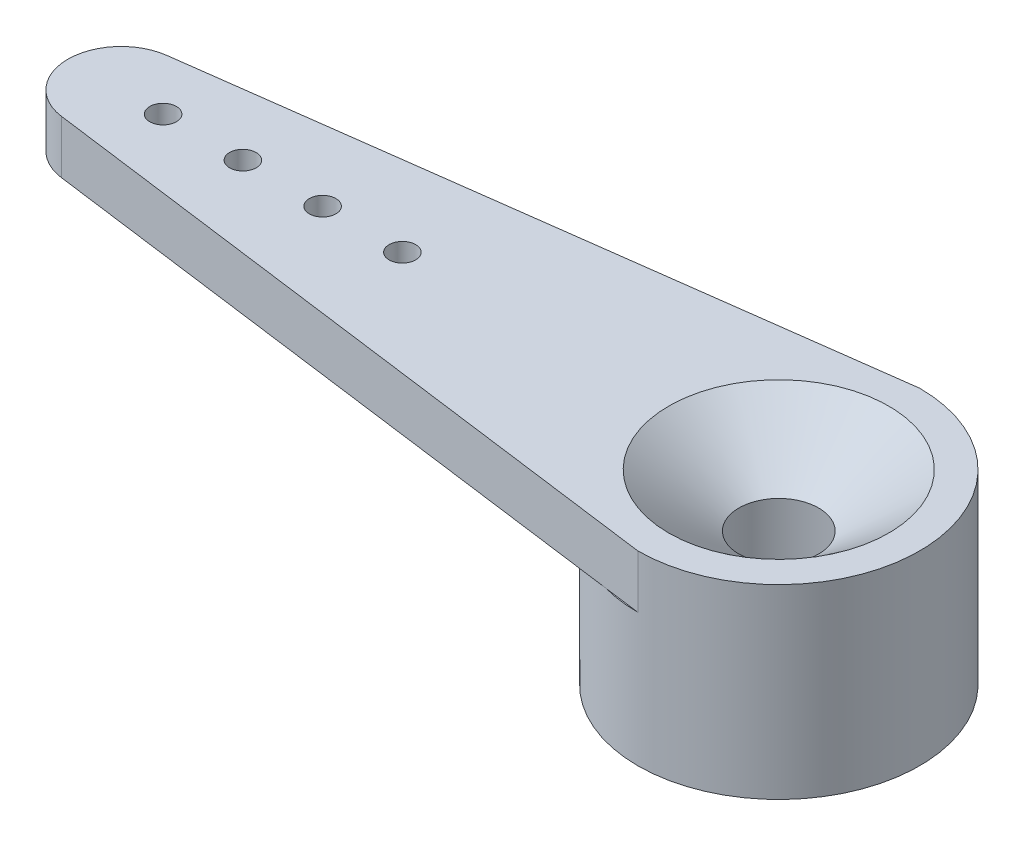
ISO-10303-21;
HEADER;
FILE_DESCRIPTION(('STEP AP214'),'2;1');
FILE_NAME('part.step','',(''),(''),'','','');
FILE_SCHEMA(('AUTOMOTIVE_DESIGN { 1 0 10303 214 1 1 1 1 }'));
ENDSEC;
DATA;
#1=APPLICATION_CONTEXT('core data for automotive mechanical design processes');
#2=APPLICATION_PROTOCOL_DEFINITION('international standard','automotive_design',2000,#1);
#3=PRODUCT_CONTEXT('',#1,'mechanical');
#4=PRODUCT('Part','Part','',(#3));
#5=PRODUCT_RELATED_PRODUCT_CATEGORY('part','',(#4));
#6=PRODUCT_DEFINITION_FORMATION('','',#4);
#7=PRODUCT_DEFINITION_CONTEXT('part definition',#1,'design');
#8=PRODUCT_DEFINITION('design','',#6,#7);
#9=PRODUCT_DEFINITION_SHAPE('','',#8);
#10=(LENGTH_UNIT() NAMED_UNIT(*) SI_UNIT(.MILLI.,.METRE.));
#11=(NAMED_UNIT(*) PLANE_ANGLE_UNIT() SI_UNIT($,.RADIAN.));
#12=(NAMED_UNIT(*) SI_UNIT($,.STERADIAN.) SOLID_ANGLE_UNIT());
#13=UNCERTAINTY_MEASURE_WITH_UNIT(LENGTH_MEASURE(1.E-05),#10,'distance_accuracy_value','');
#14=(GEOMETRIC_REPRESENTATION_CONTEXT(3) GLOBAL_UNCERTAINTY_ASSIGNED_CONTEXT((#13)) GLOBAL_UNIT_ASSIGNED_CONTEXT((#10,
#11,#12)) REPRESENTATION_CONTEXT('',''));
#15=CARTESIAN_POINT('',(0.,0.,0.));
#16=DIRECTION('',(0.,0.,1.));
#17=DIRECTION('',(1.,0.,0.));
#18=AXIS2_PLACEMENT_3D('',#15,#16,#17);
#19=CARTESIAN_POINT('',(0.,7.,0.));
#20=DIRECTION('',(0.,-1.,0.));
#21=DIRECTION('',(0.,0.,-1.));
#22=AXIS2_PLACEMENT_3D('',#19,#20,#21);
#23=PLANE('',#22);
#24=CARTESIAN_POINT('',(-14.1557519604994,7.,0.));
#25=DIRECTION('',(0.,1.,0.));
#26=DIRECTION('',(0.,0.,1.));
#27=AXIS2_PLACEMENT_3D('',#24,#25,#26);
#28=CIRCLE('',#27,0.499999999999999);
#29=CARTESIAN_POINT('',(-14.1557519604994,7.,0.499999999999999));
#30=VERTEX_POINT('',#29);
#31=EDGE_CURVE('E244',#30,#30,#28,.T.);
#32=ORIENTED_EDGE('',*,*,#31,.F.);
#33=EDGE_LOOP('',(#32));
#34=FACE_BOUND('',#33,.T.);
#35=CARTESIAN_POINT('',(-17.1557519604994,7.,0.));
#36=DIRECTION('',(0.,1.,0.));
#37=DIRECTION('',(0.,0.,1.));
#38=AXIS2_PLACEMENT_3D('',#35,#36,#37);
#39=CIRCLE('',#38,0.499999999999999);
#40=CARTESIAN_POINT('',(-17.1557519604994,7.,0.499999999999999));
#41=VERTEX_POINT('',#40);
#42=EDGE_CURVE('E248',#41,#41,#39,.T.);
#43=ORIENTED_EDGE('',*,*,#42,.F.);
#44=EDGE_LOOP('',(#43));
#45=FACE_BOUND('',#44,.T.);
#46=CARTESIAN_POINT('',(-20.1557519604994,7.,0.));
#47=DIRECTION('',(0.,1.,0.));
#48=DIRECTION('',(0.,0.,1.));
#49=AXIS2_PLACEMENT_3D('',#46,#47,#48);
#50=CIRCLE('',#49,0.499999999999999);
#51=CARTESIAN_POINT('',(-20.1557519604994,7.,0.499999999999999));
#52=VERTEX_POINT('',#51);
#53=EDGE_CURVE('E257',#52,#52,#50,.T.);
#54=ORIENTED_EDGE('',*,*,#53,.F.);
#55=EDGE_LOOP('',(#54));
#56=FACE_BOUND('',#55,.T.);
#57=CARTESIAN_POINT('',(-23.1557519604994,7.,0.));
#58=DIRECTION('',(0.,1.,0.));
#59=DIRECTION('',(0.,0.,1.));
#60=AXIS2_PLACEMENT_3D('',#57,#58,#59);
#61=CIRCLE('',#60,0.499999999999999);
#62=CARTESIAN_POINT('',(-23.1557519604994,7.,0.499999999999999));
#63=VERTEX_POINT('',#62);
#64=EDGE_CURVE('E133',#63,#63,#61,.T.);
#65=ORIENTED_EDGE('',*,*,#64,.F.);
#66=EDGE_LOOP('',(#65));
#67=FACE_BOUND('',#66,.T.);
#68=CARTESIAN_POINT('',(0.,7.,0.));
#69=DIRECTION('',(0.,1.,0.));
#70=DIRECTION('',(0.,0.,-1.));
#71=AXIS2_PLACEMENT_3D('',#68,#69,#70);
#72=CIRCLE('',#71,5.3);
#73=CARTESIAN_POINT('',(0.,7.,5.3));
#74=VERTEX_POINT('',#73);
#75=CARTESIAN_POINT('',(0.,7.,-5.3));
#76=VERTEX_POINT('',#75);
#77=EDGE_CURVE('E99',#74,#76,#72,.T.);
#78=ORIENTED_EDGE('',*,*,#77,.T.);
#79=DIRECTION('',(-0.99130954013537,0.,0.131549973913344));
#80=VECTOR('',#79,1.);
#81=CARTESIAN_POINT('',(0.,7.,-5.3));
#82=LINE('',#81,#80);
#83=CARTESIAN_POINT('',(-25.,7.,-1.98241935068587));
#84=VERTEX_POINT('',#83);
#85=EDGE_CURVE('E89',#76,#84,#82,.T.);
#86=ORIENTED_EDGE('',*,*,#85,.T.);
#87=CARTESIAN_POINT('',(-24.7353993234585,7.,0.));
#88=DIRECTION('',(0.,1.,0.));
#89=DIRECTION('',(0.,0.,-1.));
#90=AXIS2_PLACEMENT_3D('',#87,#88,#89);
#91=CIRCLE('',#90,2.);
#92=CARTESIAN_POINT('',(-25.,7.,1.98241935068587));
#93=VERTEX_POINT('',#92);
#94=EDGE_CURVE('E98',#84,#93,#91,.T.);
#95=ORIENTED_EDGE('',*,*,#94,.T.);
#96=DIRECTION('',(0.99130954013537,0.,0.131549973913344));
#97=VECTOR('',#96,1.);
#98=CARTESIAN_POINT('',(0.,7.,5.3));
#99=LINE('',#98,#97);
#100=EDGE_CURVE('E104',#93,#74,#99,.T.);
#101=ORIENTED_EDGE('',*,*,#100,.T.);
#102=EDGE_LOOP('',(#78,#86,#95,#101));
#103=FACE_BOUND('',#102,.T.);
#104=CARTESIAN_POINT('',(0.,7.,0.));
#105=DIRECTION('',(0.,1.,0.));
#106=DIRECTION('',(0.,0.,1.));
#107=AXIS2_PLACEMENT_3D('',#104,#105,#106);
#108=CIRCLE('',#107,4.13813491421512);
#109=CARTESIAN_POINT('',(0.,7.,4.13813491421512));
#110=VERTEX_POINT('',#109);
#111=EDGE_CURVE('E129',#110,#110,#108,.T.);
#112=ORIENTED_EDGE('',*,*,#111,.F.);
#113=EDGE_LOOP('',(#112));
#114=FACE_BOUND('',#113,.T.);
#115=ADVANCED_FACE('F39',(#34,#45,#56,#67,#103,#114),#23,.F.);
#116=CARTESIAN_POINT('',(0.,5.,0.));
#117=DIRECTION('',(0.,1.,0.));
#118=DIRECTION('',(0.,0.,1.));
#119=AXIS2_PLACEMENT_3D('',#116,#117,#118);
#120=PLANE('',#119);
#121=DIRECTION('',(0.99130954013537,0.,0.131549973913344));
#122=VECTOR('',#121,1.);
#123=CARTESIAN_POINT('',(0.,5.,5.3));
#124=LINE('',#123,#122);
#125=CARTESIAN_POINT('',(-1.38231148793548,5.,5.11656280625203));
#126=VERTEX_POINT('',#125);
#127=CARTESIAN_POINT('',(0.,5.,5.3));
#128=VERTEX_POINT('',#127);
#129=EDGE_CURVE('E12',#126,#128,#124,.T.);
#130=ORIENTED_EDGE('',*,*,#129,.F.);
#131=CARTESIAN_POINT('',(0.,5.,0.));
#132=DIRECTION('',(0.,1.,0.));
#133=DIRECTION('',(0.,0.,1.));
#134=AXIS2_PLACEMENT_3D('',#131,#132,#133);
#135=CIRCLE('',#134,5.3);
#136=EDGE_CURVE('E123',#126,#128,#135,.T.);
#137=ORIENTED_EDGE('',*,*,#136,.T.);
#138=EDGE_LOOP('',(#130,#137));
#139=FACE_BOUND('',#138,.T.);
#140=ADVANCED_FACE('F169',(#139),#120,.T.);
#141=DIRECTION('',(-0.99130954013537,0.,0.131549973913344));
#142=VECTOR('',#141,1.);
#143=CARTESIAN_POINT('',(0.,5.,-5.3));
#144=LINE('',#143,#142);
#145=CARTESIAN_POINT('',(0.,5.,-5.3));
#146=VERTEX_POINT('',#145);
#147=CARTESIAN_POINT('',(-1.38231148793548,5.,-5.11656280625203));
#148=VERTEX_POINT('',#147);
#149=EDGE_CURVE('E63',#146,#148,#144,.T.);
#150=ORIENTED_EDGE('',*,*,#149,.F.);
#151=EDGE_CURVE('E50',#146,#148,#135,.T.);
#152=ORIENTED_EDGE('',*,*,#151,.T.);
#153=EDGE_LOOP('',(#150,#152));
#154=FACE_BOUND('',#153,.T.);
#155=ADVANCED_FACE('F166',(#154),#120,.T.);
#156=CARTESIAN_POINT('',(0.,0.,0.));
#157=DIRECTION('',(0.,1.,0.));
#158=DIRECTION('',(0.,0.,1.));
#159=AXIS2_PLACEMENT_3D('',#156,#157,#158);
#160=PLANE('',#159);
#161=CARTESIAN_POINT('',(0.,0.,0.));
#162=DIRECTION('',(0.,1.,0.));
#163=DIRECTION('',(0.,0.,1.));
#164=AXIS2_PLACEMENT_3D('',#161,#162,#163);
#165=CIRCLE('',#164,5.3);
#166=CARTESIAN_POINT('',(0.,0.,5.3));
#167=VERTEX_POINT('',#166);
#168=EDGE_CURVE('E122',#167,#167,#165,.T.);
#169=ORIENTED_EDGE('',*,*,#168,.F.);
#170=EDGE_LOOP('',(#169));
#171=FACE_BOUND('',#170,.T.);
#172=CARTESIAN_POINT('',(0.,0.,0.));
#173=DIRECTION('',(0.,1.,0.));
#174=DIRECTION('',(0.,0.,1.));
#175=AXIS2_PLACEMENT_3D('',#172,#173,#174);
#176=CIRCLE('',#175,2.8);
#177=CARTESIAN_POINT('',(0.,0.,2.8));
#178=VERTEX_POINT('',#177);
#179=EDGE_CURVE('E114',#178,#178,#176,.T.);
#180=ORIENTED_EDGE('',*,*,#179,.T.);
#181=EDGE_LOOP('',(#180));
#182=FACE_BOUND('',#181,.T.);
#183=ADVANCED_FACE('F168',(#171,#182),#160,.F.);
#184=CARTESIAN_POINT('',(0.,5.,0.));
#185=DIRECTION('',(0.,-1.,0.));
#186=DIRECTION('',(0.,0.,-1.));
#187=AXIS2_PLACEMENT_3D('',#184,#185,#186);
#188=CYLINDRICAL_SURFACE('',#187,5.3);
#189=ORIENTED_EDGE('',*,*,#151,.F.);
#190=DIRECTION('',(0.,-1.,0.));
#191=VECTOR('',#190,1.);
#192=CARTESIAN_POINT('',(0.,7.,-5.3));
#193=LINE('',#192,#191);
#194=EDGE_CURVE('E93',#76,#146,#193,.T.);
#195=ORIENTED_EDGE('',*,*,#194,.F.);
#196=ORIENTED_EDGE('',*,*,#77,.F.);
#197=DIRECTION('',(0.,-1.,0.));
#198=VECTOR('',#197,1.);
#199=CARTESIAN_POINT('',(0.,7.,5.3));
#200=LINE('',#199,#198);
#201=EDGE_CURVE('E150',#74,#128,#200,.T.);
#202=ORIENTED_EDGE('',*,*,#201,.T.);
#203=ORIENTED_EDGE('',*,*,#136,.F.);
#204=EDGE_CURVE('E125',#148,#126,#135,.T.);
#205=ORIENTED_EDGE('',*,*,#204,.F.);
#206=EDGE_LOOP('',(#189,#195,#196,#202,#203,#205));
#207=FACE_BOUND('',#206,.T.);
#208=ORIENTED_EDGE('',*,*,#168,.T.);
#209=EDGE_LOOP('',(#208));
#210=FACE_BOUND('',#209,.T.);
#211=ADVANCED_FACE('F41',(#207,#210),#188,.T.);
#212=CARTESIAN_POINT('',(0.,5.,0.));
#213=DIRECTION('',(0.,-1.,0.));
#214=DIRECTION('',(0.,0.,-1.));
#215=AXIS2_PLACEMENT_3D('',#212,#213,#214);
#216=CYLINDRICAL_SURFACE('',#215,2.8);
#217=CARTESIAN_POINT('',(0.,5.,0.));
#218=DIRECTION('',(0.,1.,0.));
#219=DIRECTION('',(0.,0.,1.));
#220=AXIS2_PLACEMENT_3D('',#217,#218,#219);
#221=CIRCLE('',#220,2.8);
#222=CARTESIAN_POINT('',(0.,5.,2.8));
#223=VERTEX_POINT('',#222);
#224=EDGE_CURVE('E111',#223,#223,#221,.T.);
#225=ORIENTED_EDGE('',*,*,#224,.T.);
#226=EDGE_LOOP('',(#225));
#227=FACE_BOUND('',#226,.T.);
#228=ORIENTED_EDGE('',*,*,#179,.F.);
#229=EDGE_LOOP('',(#228));
#230=FACE_BOUND('',#229,.T.);
#231=ADVANCED_FACE('F190',(#227,#230),#216,.F.);
#232=CARTESIAN_POINT('',(0.,5.,0.));
#233=DIRECTION('',(0.,-1.,0.));
#234=DIRECTION('',(0.,0.,-1.));
#235=AXIS2_PLACEMENT_3D('',#232,#233,#234);
#236=PLANE('',#235);
#237=CARTESIAN_POINT('',(-14.1557519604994,5.,0.));
#238=DIRECTION('',(0.,-1.,0.));
#239=DIRECTION('',(0.,0.,-1.));
#240=AXIS2_PLACEMENT_3D('',#237,#238,#239);
#241=CIRCLE('',#240,0.499999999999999);
#242=CARTESIAN_POINT('',(-14.1557519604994,5.,-0.499999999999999));
#243=VERTEX_POINT('',#242);
#244=EDGE_CURVE('E242',#243,#243,#241,.F.);
#245=ORIENTED_EDGE('',*,*,#244,.T.);
#246=EDGE_LOOP('',(#245));
#247=FACE_BOUND('',#246,.T.);
#248=CARTESIAN_POINT('',(-17.1557519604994,5.,0.));
#249=DIRECTION('',(0.,-1.,0.));
#250=DIRECTION('',(0.,0.,-1.));
#251=AXIS2_PLACEMENT_3D('',#248,#249,#250);
#252=CIRCLE('',#251,0.499999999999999);
#253=CARTESIAN_POINT('',(-17.1557519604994,5.,-0.499999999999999));
#254=VERTEX_POINT('',#253);
#255=EDGE_CURVE('E245',#254,#254,#252,.F.);
#256=ORIENTED_EDGE('',*,*,#255,.T.);
#257=EDGE_LOOP('',(#256));
#258=FACE_BOUND('',#257,.T.);
#259=CARTESIAN_POINT('',(-20.1557519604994,5.,0.));
#260=DIRECTION('',(0.,-1.,0.));
#261=DIRECTION('',(0.,0.,-1.));
#262=AXIS2_PLACEMENT_3D('',#259,#260,#261);
#263=CIRCLE('',#262,0.499999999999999);
#264=CARTESIAN_POINT('',(-20.1557519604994,5.,-0.499999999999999));
#265=VERTEX_POINT('',#264);
#266=EDGE_CURVE('E254',#265,#265,#263,.F.);
#267=ORIENTED_EDGE('',*,*,#266,.T.);
#268=EDGE_LOOP('',(#267));
#269=FACE_BOUND('',#268,.T.);
#270=CARTESIAN_POINT('',(-23.1557519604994,5.,0.));
#271=DIRECTION('',(0.,-1.,0.));
#272=DIRECTION('',(0.,0.,-1.));
#273=AXIS2_PLACEMENT_3D('',#270,#271,#272);
#274=CIRCLE('',#273,0.499999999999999);
#275=CARTESIAN_POINT('',(-23.1557519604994,5.,-0.499999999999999));
#276=VERTEX_POINT('',#275);
#277=EDGE_CURVE('E139',#276,#276,#274,.F.);
#278=ORIENTED_EDGE('',*,*,#277,.T.);
#279=EDGE_LOOP('',(#278));
#280=FACE_BOUND('',#279,.T.);
#281=CARTESIAN_POINT('',(-25.,5.,-1.98241935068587));
#282=VERTEX_POINT('',#281);
#283=EDGE_CURVE('E136',#148,#282,#144,.T.);
#284=ORIENTED_EDGE('',*,*,#283,.F.);
#285=ORIENTED_EDGE('',*,*,#204,.T.);
#286=CARTESIAN_POINT('',(-25.,5.,1.98241935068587));
#287=VERTEX_POINT('',#286);
#288=EDGE_CURVE('E52',#287,#126,#124,.T.);
#289=ORIENTED_EDGE('',*,*,#288,.F.);
#290=CARTESIAN_POINT('',(-24.7353993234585,5.,0.));
#291=DIRECTION('',(0.,1.,0.));
#292=DIRECTION('',(0.,0.,-1.));
#293=AXIS2_PLACEMENT_3D('',#290,#291,#292);
#294=CIRCLE('',#293,2.);
#295=EDGE_CURVE('E152',#282,#287,#294,.T.);
#296=ORIENTED_EDGE('',*,*,#295,.F.);
#297=EDGE_LOOP('',(#284,#285,#289,#296));
#298=FACE_BOUND('',#297,.T.);
#299=ADVANCED_FACE('F165',(#247,#258,#269,#280,#298),#236,.T.);
#300=CARTESIAN_POINT('',(0.,7.,5.3));
#301=DIRECTION('',(0.131549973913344,0.,-0.99130954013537));
#302=DIRECTION('',(-0.99130954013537,0.,-0.131549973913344));
#303=AXIS2_PLACEMENT_3D('',#300,#301,#302);
#304=PLANE('',#303);
#305=ORIENTED_EDGE('',*,*,#288,.T.);
#306=ORIENTED_EDGE('',*,*,#129,.T.);
#307=ORIENTED_EDGE('',*,*,#201,.F.);
#308=ORIENTED_EDGE('',*,*,#100,.F.);
#309=DIRECTION('',(0.,-1.,0.));
#310=VECTOR('',#309,1.);
#311=CARTESIAN_POINT('',(-25.,7.,1.98241935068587));
#312=LINE('',#311,#310);
#313=EDGE_CURVE('E116',#93,#287,#312,.T.);
#314=ORIENTED_EDGE('',*,*,#313,.T.);
#315=EDGE_LOOP('',(#305,#306,#307,#308,#314));
#316=FACE_BOUND('',#315,.T.);
#317=ADVANCED_FACE('F159',(#316),#304,.F.);
#318=CARTESIAN_POINT('',(-24.7353993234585,7.,0.));
#319=DIRECTION('',(0.,-1.,0.));
#320=DIRECTION('',(0.,0.,-1.));
#321=AXIS2_PLACEMENT_3D('',#318,#319,#320);
#322=CYLINDRICAL_SURFACE('',#321,2.);
#323=ORIENTED_EDGE('',*,*,#295,.T.);
#324=ORIENTED_EDGE('',*,*,#313,.F.);
#325=ORIENTED_EDGE('',*,*,#94,.F.);
#326=DIRECTION('',(0.,-1.,0.));
#327=VECTOR('',#326,1.);
#328=CARTESIAN_POINT('',(-25.,7.,-1.98241935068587));
#329=LINE('',#328,#327);
#330=EDGE_CURVE('E95',#84,#282,#329,.T.);
#331=ORIENTED_EDGE('',*,*,#330,.T.);
#332=EDGE_LOOP('',(#323,#324,#325,#331));
#333=FACE_BOUND('',#332,.T.);
#334=ADVANCED_FACE('F195',(#333),#322,.T.);
#335=CARTESIAN_POINT('',(0.,7.,-5.3));
#336=DIRECTION('',(0.131549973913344,0.,0.99130954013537));
#337=DIRECTION('',(0.99130954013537,0.,-0.131549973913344));
#338=AXIS2_PLACEMENT_3D('',#335,#336,#337);
#339=PLANE('',#338);
#340=ORIENTED_EDGE('',*,*,#149,.T.);
#341=ORIENTED_EDGE('',*,*,#283,.T.);
#342=ORIENTED_EDGE('',*,*,#330,.F.);
#343=ORIENTED_EDGE('',*,*,#85,.F.);
#344=ORIENTED_EDGE('',*,*,#194,.T.);
#345=EDGE_LOOP('',(#340,#341,#342,#343,#344));
#346=FACE_BOUND('',#345,.T.);
#347=ADVANCED_FACE('F91',(#346),#339,.F.);
#348=CARTESIAN_POINT('',(0.,5.,0.));
#349=DIRECTION('',(0.,1.,0.));
#350=DIRECTION('',(0.,0.,1.));
#351=AXIS2_PLACEMENT_3D('',#348,#349,#350);
#352=CIRCLE('',#351,1.5);
#353=CARTESIAN_POINT('',(0.,5.,1.5));
#354=VERTEX_POINT('',#353);
#355=EDGE_CURVE('E132',#354,#354,#352,.T.);
#356=ORIENTED_EDGE('',*,*,#355,.T.);
#357=EDGE_LOOP('',(#356));
#358=FACE_BOUND('',#357,.T.);
#359=ORIENTED_EDGE('',*,*,#224,.F.);
#360=EDGE_LOOP('',(#359));
#361=FACE_BOUND('',#360,.T.);
#362=ADVANCED_FACE('F192',(#358,#361),#236,.T.);
#363=CARTESIAN_POINT('',(0.,5.,0.));
#364=DIRECTION('',(0.,1.,0.));
#365=DIRECTION('',(0.,0.,1.));
#366=AXIS2_PLACEMENT_3D('',#363,#364,#365);
#367=CONICAL_SURFACE('',#366,1.5,0.922124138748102);
#368=ORIENTED_EDGE('',*,*,#111,.T.);
#369=EDGE_LOOP('',(#368));
#370=FACE_BOUND('',#369,.T.);
#371=ORIENTED_EDGE('',*,*,#355,.F.);
#372=EDGE_LOOP('',(#371));
#373=FACE_BOUND('',#372,.T.);
#374=ADVANCED_FACE('F185',(#370,#373),#367,.F.);
#375=CARTESIAN_POINT('',(-23.1557519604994,-0.00100000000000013,0.));
#376=DIRECTION('',(0.,1.,0.));
#377=DIRECTION('',(0.,0.,1.));
#378=AXIS2_PLACEMENT_3D('',#375,#376,#377);
#379=CYLINDRICAL_SURFACE('',#378,0.499999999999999);
#380=ORIENTED_EDGE('',*,*,#277,.F.);
#381=EDGE_LOOP('',(#380));
#382=FACE_BOUND('',#381,.T.);
#383=ORIENTED_EDGE('',*,*,#64,.T.);
#384=EDGE_LOOP('',(#383));
#385=FACE_BOUND('',#384,.T.);
#386=ADVANCED_FACE('F214',(#382,#385),#379,.F.);
#387=CARTESIAN_POINT('',(-20.1557519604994,-0.00100000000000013,0.));
#388=DIRECTION('',(0.,1.,0.));
#389=DIRECTION('',(0.,0.,1.));
#390=AXIS2_PLACEMENT_3D('',#387,#388,#389);
#391=CYLINDRICAL_SURFACE('',#390,0.499999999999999);
#392=ORIENTED_EDGE('',*,*,#266,.F.);
#393=EDGE_LOOP('',(#392));
#394=FACE_BOUND('',#393,.T.);
#395=ORIENTED_EDGE('',*,*,#53,.T.);
#396=EDGE_LOOP('',(#395));
#397=FACE_BOUND('',#396,.T.);
#398=ADVANCED_FACE('F220',(#394,#397),#391,.F.);
#399=CARTESIAN_POINT('',(-17.1557519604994,-0.00100000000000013,0.));
#400=DIRECTION('',(0.,1.,0.));
#401=DIRECTION('',(0.,0.,1.));
#402=AXIS2_PLACEMENT_3D('',#399,#400,#401);
#403=CYLINDRICAL_SURFACE('',#402,0.499999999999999);
#404=ORIENTED_EDGE('',*,*,#255,.F.);
#405=EDGE_LOOP('',(#404));
#406=FACE_BOUND('',#405,.T.);
#407=ORIENTED_EDGE('',*,*,#42,.T.);
#408=EDGE_LOOP('',(#407));
#409=FACE_BOUND('',#408,.T.);
#410=ADVANCED_FACE('F225',(#406,#409),#403,.F.);
#411=CARTESIAN_POINT('',(-14.1557519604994,-0.00100000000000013,0.));
#412=DIRECTION('',(0.,1.,0.));
#413=DIRECTION('',(0.,0.,1.));
#414=AXIS2_PLACEMENT_3D('',#411,#412,#413);
#415=CYLINDRICAL_SURFACE('',#414,0.499999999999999);
#416=ORIENTED_EDGE('',*,*,#244,.F.);
#417=EDGE_LOOP('',(#416));
#418=FACE_BOUND('',#417,.T.);
#419=ORIENTED_EDGE('',*,*,#31,.T.);
#420=EDGE_LOOP('',(#419));
#421=FACE_BOUND('',#420,.T.);
#422=ADVANCED_FACE('F233',(#418,#421),#415,.F.);
#423=CLOSED_SHELL('',(#115,#140,#155,#183,#211,#231,#299,#317,#334,#347,#362,#374,#386,#398,
#410,#422));
#424=MANIFOLD_SOLID_BREP('B2',#423);
#425=ADVANCED_BREP_SHAPE_REPRESENTATION('',(#18,#424),#14);
#426=SHAPE_DEFINITION_REPRESENTATION(#9,#425);
ENDSEC;
END-ISO-10303-21;
